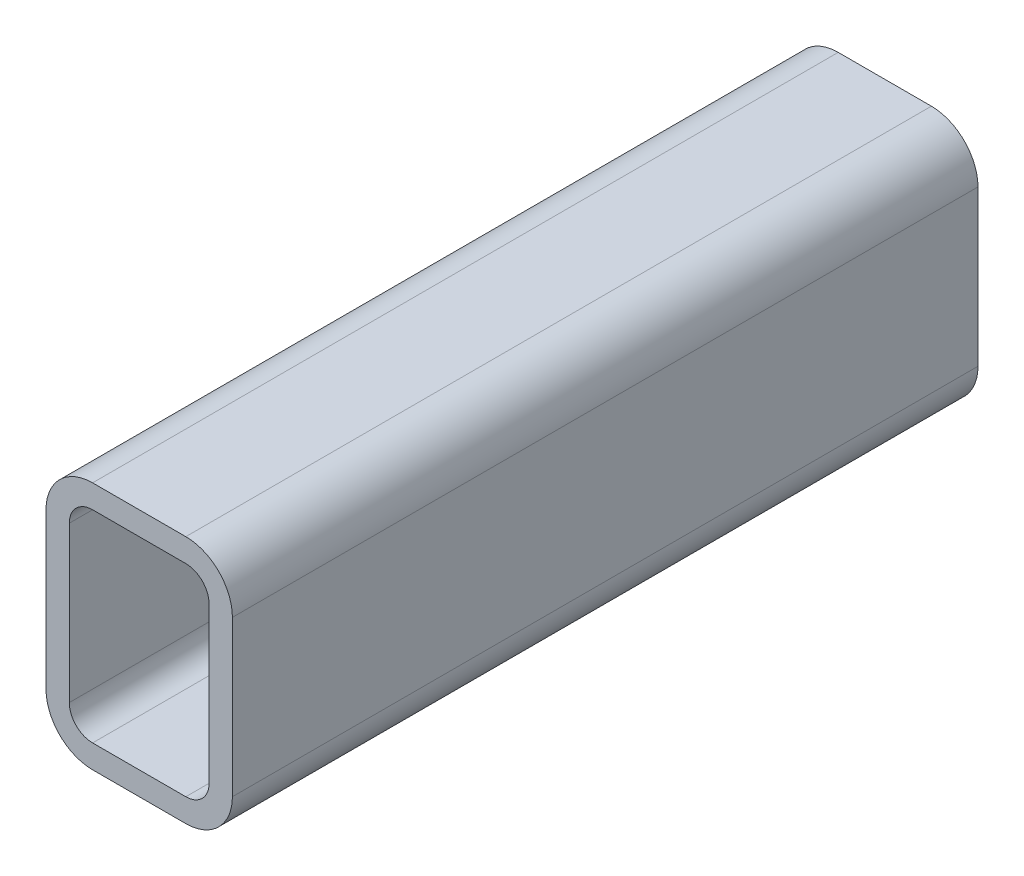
ISO-10303-21;
HEADER;
FILE_DESCRIPTION(('STEP AP214'),'2;1');
FILE_NAME('part.step','',(''),(''),'','','');
FILE_SCHEMA(('AUTOMOTIVE_DESIGN { 1 0 10303 214 1 1 1 1 }'));
ENDSEC;
DATA;
#1=APPLICATION_CONTEXT('core data for automotive mechanical design processes');
#2=APPLICATION_PROTOCOL_DEFINITION('international standard','automotive_design',2000,#1);
#3=PRODUCT_CONTEXT('',#1,'mechanical');
#4=PRODUCT('Part','Part','',(#3));
#5=PRODUCT_RELATED_PRODUCT_CATEGORY('part','',(#4));
#6=PRODUCT_DEFINITION_FORMATION('','',#4);
#7=PRODUCT_DEFINITION_CONTEXT('part definition',#1,'design');
#8=PRODUCT_DEFINITION('design','',#6,#7);
#9=PRODUCT_DEFINITION_SHAPE('','',#8);
#10=(LENGTH_UNIT() NAMED_UNIT(*) SI_UNIT(.MILLI.,.METRE.));
#11=(NAMED_UNIT(*) PLANE_ANGLE_UNIT() SI_UNIT($,.RADIAN.));
#12=(NAMED_UNIT(*) SI_UNIT($,.STERADIAN.) SOLID_ANGLE_UNIT());
#13=UNCERTAINTY_MEASURE_WITH_UNIT(LENGTH_MEASURE(1.E-05),#10,'distance_accuracy_value','');
#14=(GEOMETRIC_REPRESENTATION_CONTEXT(3) GLOBAL_UNCERTAINTY_ASSIGNED_CONTEXT((#13)) GLOBAL_UNIT_ASSIGNED_CONTEXT((#10,
#11,#12)) REPRESENTATION_CONTEXT('',''));
#15=CARTESIAN_POINT('',(0.,0.,0.));
#16=DIRECTION('',(0.,0.,1.));
#17=DIRECTION('',(1.,0.,0.));
#18=AXIS2_PLACEMENT_3D('',#15,#16,#17);
#19=CARTESIAN_POINT('',(21.5391160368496,84.6077651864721,304.8));
#20=DIRECTION('',(0.,0.,1.));
#21=DIRECTION('',(1.,0.,0.));
#22=AXIS2_PLACEMENT_3D('',#19,#20,#21);
#23=PLANE('',#22);
#24=CARTESIAN_POINT('',(21.5391160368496,84.6077651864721,304.8));
#25=DIRECTION('',(0.,0.,1.));
#26=DIRECTION('',(1.,0.,0.));
#27=AXIS2_PLACEMENT_3D('',#24,#25,#26);
#28=CIRCLE('',#27,19.05);
#29=CARTESIAN_POINT('',(21.5391160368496,103.657765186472,304.8));
#30=VERTEX_POINT('',#29);
#31=CARTESIAN_POINT('',(2.48911603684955,84.6077651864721,304.8));
#32=VERTEX_POINT('',#31);
#33=EDGE_CURVE('E211',#30,#32,#28,.T.);
#34=ORIENTED_EDGE('',*,*,#33,.T.);
#35=DIRECTION('',(0.,-1.,0.));
#36=VECTOR('',#35,1.);
#37=CARTESIAN_POINT('',(2.48911603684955,21.1077651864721,304.8));
#38=LINE('',#37,#36);
#39=CARTESIAN_POINT('',(2.48911603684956,21.1077651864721,304.8));
#40=VERTEX_POINT('',#39);
#41=EDGE_CURVE('E214',#32,#40,#38,.T.);
#42=ORIENTED_EDGE('',*,*,#41,.T.);
#43=CARTESIAN_POINT('',(21.5391160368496,21.1077651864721,304.8));
#44=DIRECTION('',(0.,0.,1.));
#45=DIRECTION('',(1.,0.,0.));
#46=AXIS2_PLACEMENT_3D('',#43,#44,#45);
#47=CIRCLE('',#46,19.05);
#48=CARTESIAN_POINT('',(21.5391160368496,2.05776518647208,304.8));
#49=VERTEX_POINT('',#48);
#50=EDGE_CURVE('E217',#40,#49,#47,.T.);
#51=ORIENTED_EDGE('',*,*,#50,.T.);
#52=DIRECTION('',(1.,0.,0.));
#53=VECTOR('',#52,1.);
#54=CARTESIAN_POINT('',(59.6391160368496,2.05776518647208,304.8));
#55=LINE('',#54,#53);
#56=CARTESIAN_POINT('',(59.6391160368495,2.05776518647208,304.8));
#57=VERTEX_POINT('',#56);
#58=EDGE_CURVE('E219',#49,#57,#55,.T.);
#59=ORIENTED_EDGE('',*,*,#58,.T.);
#60=CARTESIAN_POINT('',(59.6391160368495,21.1077651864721,304.8));
#61=DIRECTION('',(0.,0.,1.));
#62=DIRECTION('',(1.,0.,0.));
#63=AXIS2_PLACEMENT_3D('',#60,#61,#62);
#64=CIRCLE('',#63,19.05);
#65=CARTESIAN_POINT('',(78.6891160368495,21.1077651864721,304.8));
#66=VERTEX_POINT('',#65);
#67=EDGE_CURVE('E221',#57,#66,#64,.T.);
#68=ORIENTED_EDGE('',*,*,#67,.T.);
#69=DIRECTION('',(0.,1.,0.));
#70=VECTOR('',#69,1.);
#71=CARTESIAN_POINT('',(78.6891160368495,84.6077651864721,304.8));
#72=LINE('',#71,#70);
#73=CARTESIAN_POINT('',(78.6891160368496,84.6077651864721,304.8));
#74=VERTEX_POINT('',#73);
#75=EDGE_CURVE('E223',#66,#74,#72,.T.);
#76=ORIENTED_EDGE('',*,*,#75,.T.);
#77=CARTESIAN_POINT('',(59.6391160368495,84.6077651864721,304.8));
#78=DIRECTION('',(0.,0.,1.));
#79=DIRECTION('',(1.,0.,0.));
#80=AXIS2_PLACEMENT_3D('',#77,#78,#79);
#81=CIRCLE('',#80,19.05);
#82=CARTESIAN_POINT('',(59.6391160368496,103.657765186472,304.8));
#83=VERTEX_POINT('',#82);
#84=EDGE_CURVE('E225',#74,#83,#81,.T.);
#85=ORIENTED_EDGE('',*,*,#84,.T.);
#86=DIRECTION('',(-1.,0.,0.));
#87=VECTOR('',#86,1.);
#88=CARTESIAN_POINT('',(21.5391160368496,103.657765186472,304.8));
#89=LINE('',#88,#87);
#90=EDGE_CURVE('E227',#83,#30,#89,.T.);
#91=ORIENTED_EDGE('',*,*,#90,.T.);
#92=EDGE_LOOP('',(#34,#42,#51,#59,#68,#76,#85,#91));
#93=FACE_BOUND('',#92,.T.);
#94=DIRECTION('',(0.,-1.,0.));
#95=VECTOR('',#94,1.);
#96=CARTESIAN_POINT('',(12.0141160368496,21.1077651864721,304.8));
#97=LINE('',#96,#95);
#98=CARTESIAN_POINT('',(12.0141160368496,84.6077651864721,304.8));
#99=VERTEX_POINT('',#98);
#100=CARTESIAN_POINT('',(12.0141160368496,21.1077651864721,304.8));
#101=VERTEX_POINT('',#100);
#102=EDGE_CURVE('E154',#99,#101,#97,.T.);
#103=ORIENTED_EDGE('',*,*,#102,.F.);
#104=CARTESIAN_POINT('',(21.5391160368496,84.6077651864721,304.8));
#105=DIRECTION('',(0.,0.,1.));
#106=DIRECTION('',(1.,0.,0.));
#107=AXIS2_PLACEMENT_3D('',#104,#105,#106);
#108=CIRCLE('',#107,9.52500000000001);
#109=CARTESIAN_POINT('',(21.5391160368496,94.1327651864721,304.8));
#110=VERTEX_POINT('',#109);
#111=EDGE_CURVE('E146',#110,#99,#108,.T.);
#112=ORIENTED_EDGE('',*,*,#111,.F.);
#113=DIRECTION('',(-1.,0.,0.));
#114=VECTOR('',#113,1.);
#115=CARTESIAN_POINT('',(21.5391160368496,94.1327651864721,304.8));
#116=LINE('',#115,#114);
#117=CARTESIAN_POINT('',(59.6391160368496,94.1327651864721,304.8));
#118=VERTEX_POINT('',#117);
#119=EDGE_CURVE('E179',#118,#110,#116,.T.);
#120=ORIENTED_EDGE('',*,*,#119,.F.);
#121=CARTESIAN_POINT('',(59.6391160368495,84.6077651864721,304.8));
#122=DIRECTION('',(0.,0.,1.));
#123=DIRECTION('',(1.,0.,0.));
#124=AXIS2_PLACEMENT_3D('',#121,#122,#123);
#125=CIRCLE('',#124,9.52500000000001);
#126=CARTESIAN_POINT('',(69.1641160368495,84.6077651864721,304.8));
#127=VERTEX_POINT('',#126);
#128=EDGE_CURVE('E177',#127,#118,#125,.T.);
#129=ORIENTED_EDGE('',*,*,#128,.F.);
#130=DIRECTION('',(0.,1.,0.));
#131=VECTOR('',#130,1.);
#132=CARTESIAN_POINT('',(69.1641160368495,84.6077651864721,304.8));
#133=LINE('',#132,#131);
#134=CARTESIAN_POINT('',(69.1641160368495,21.1077651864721,304.8));
#135=VERTEX_POINT('',#134);
#136=EDGE_CURVE('E175',#135,#127,#133,.T.);
#137=ORIENTED_EDGE('',*,*,#136,.F.);
#138=CARTESIAN_POINT('',(59.6391160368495,21.1077651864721,304.8));
#139=DIRECTION('',(0.,0.,1.));
#140=DIRECTION('',(1.,0.,0.));
#141=AXIS2_PLACEMENT_3D('',#138,#139,#140);
#142=CIRCLE('',#141,9.525);
#143=CARTESIAN_POINT('',(59.6391160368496,11.5827651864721,304.8));
#144=VERTEX_POINT('',#143);
#145=EDGE_CURVE('E173',#144,#135,#142,.T.);
#146=ORIENTED_EDGE('',*,*,#145,.F.);
#147=DIRECTION('',(1.,0.,0.));
#148=VECTOR('',#147,1.);
#149=CARTESIAN_POINT('',(59.6391160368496,11.5827651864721,304.8));
#150=LINE('',#149,#148);
#151=CARTESIAN_POINT('',(21.5391160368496,11.5827651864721,304.8));
#152=VERTEX_POINT('',#151);
#153=EDGE_CURVE('E169',#152,#144,#150,.T.);
#154=ORIENTED_EDGE('',*,*,#153,.F.);
#155=CARTESIAN_POINT('',(21.5391160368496,21.1077651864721,304.8));
#156=DIRECTION('',(0.,0.,1.));
#157=DIRECTION('',(1.,0.,0.));
#158=AXIS2_PLACEMENT_3D('',#155,#156,#157);
#159=CIRCLE('',#158,9.525);
#160=EDGE_CURVE('E167',#101,#152,#159,.T.);
#161=ORIENTED_EDGE('',*,*,#160,.F.);
#162=EDGE_LOOP('',(#103,#112,#120,#129,#137,#146,#154,#161));
#163=FACE_BOUND('',#162,.T.);
#164=ADVANCED_FACE('F33',(#93,#163),#23,.T.);
#165=CARTESIAN_POINT('',(21.5391160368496,84.6077651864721,0.));
#166=DIRECTION('',(0.,0.,1.));
#167=DIRECTION('',(1.,0.,0.));
#168=AXIS2_PLACEMENT_3D('',#165,#166,#167);
#169=PLANE('',#168);
#170=CARTESIAN_POINT('',(21.5391160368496,84.6077651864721,0.));
#171=DIRECTION('',(0.,0.,1.));
#172=DIRECTION('',(1.,0.,0.));
#173=AXIS2_PLACEMENT_3D('',#170,#171,#172);
#174=CIRCLE('',#173,19.05);
#175=CARTESIAN_POINT('',(21.5391160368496,103.657765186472,0.));
#176=VERTEX_POINT('',#175);
#177=CARTESIAN_POINT('',(2.48911603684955,84.6077651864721,0.));
#178=VERTEX_POINT('',#177);
#179=EDGE_CURVE('E162',#176,#178,#174,.T.);
#180=ORIENTED_EDGE('',*,*,#179,.F.);
#181=DIRECTION('',(-1.,0.,0.));
#182=VECTOR('',#181,1.);
#183=CARTESIAN_POINT('',(21.5391160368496,103.657765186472,0.));
#184=LINE('',#183,#182);
#185=CARTESIAN_POINT('',(59.6391160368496,103.657765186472,0.));
#186=VERTEX_POINT('',#185);
#187=EDGE_CURVE('E215',#186,#176,#184,.T.);
#188=ORIENTED_EDGE('',*,*,#187,.F.);
#189=CARTESIAN_POINT('',(59.6391160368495,84.6077651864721,0.));
#190=DIRECTION('',(0.,0.,1.));
#191=DIRECTION('',(1.,0.,0.));
#192=AXIS2_PLACEMENT_3D('',#189,#190,#191);
#193=CIRCLE('',#192,19.05);
#194=CARTESIAN_POINT('',(78.6891160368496,84.6077651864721,0.));
#195=VERTEX_POINT('',#194);
#196=EDGE_CURVE('E242',#195,#186,#193,.T.);
#197=ORIENTED_EDGE('',*,*,#196,.F.);
#198=DIRECTION('',(0.,1.,0.));
#199=VECTOR('',#198,1.);
#200=CARTESIAN_POINT('',(78.6891160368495,84.6077651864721,0.));
#201=LINE('',#200,#199);
#202=CARTESIAN_POINT('',(78.6891160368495,21.1077651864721,0.));
#203=VERTEX_POINT('',#202);
#204=EDGE_CURVE('E240',#203,#195,#201,.T.);
#205=ORIENTED_EDGE('',*,*,#204,.F.);
#206=CARTESIAN_POINT('',(59.6391160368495,21.1077651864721,0.));
#207=DIRECTION('',(0.,0.,1.));
#208=DIRECTION('',(1.,0.,0.));
#209=AXIS2_PLACEMENT_3D('',#206,#207,#208);
#210=CIRCLE('',#209,19.05);
#211=CARTESIAN_POINT('',(59.6391160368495,2.05776518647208,0.));
#212=VERTEX_POINT('',#211);
#213=EDGE_CURVE('E238',#212,#203,#210,.T.);
#214=ORIENTED_EDGE('',*,*,#213,.F.);
#215=DIRECTION('',(1.,0.,0.));
#216=VECTOR('',#215,1.);
#217=CARTESIAN_POINT('',(59.6391160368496,2.05776518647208,0.));
#218=LINE('',#217,#216);
#219=CARTESIAN_POINT('',(21.5391160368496,2.05776518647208,0.));
#220=VERTEX_POINT('',#219);
#221=EDGE_CURVE('E236',#220,#212,#218,.T.);
#222=ORIENTED_EDGE('',*,*,#221,.F.);
#223=CARTESIAN_POINT('',(21.5391160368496,21.1077651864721,0.));
#224=DIRECTION('',(0.,0.,1.));
#225=DIRECTION('',(1.,0.,0.));
#226=AXIS2_PLACEMENT_3D('',#223,#224,#225);
#227=CIRCLE('',#226,19.05);
#228=CARTESIAN_POINT('',(2.48911603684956,21.1077651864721,0.));
#229=VERTEX_POINT('',#228);
#230=EDGE_CURVE('E234',#229,#220,#227,.T.);
#231=ORIENTED_EDGE('',*,*,#230,.F.);
#232=DIRECTION('',(0.,-1.,0.));
#233=VECTOR('',#232,1.);
#234=CARTESIAN_POINT('',(2.48911603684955,21.1077651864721,0.));
#235=LINE('',#234,#233);
#236=EDGE_CURVE('E232',#178,#229,#235,.T.);
#237=ORIENTED_EDGE('',*,*,#236,.F.);
#238=EDGE_LOOP('',(#180,#188,#197,#205,#214,#222,#231,#237));
#239=FACE_BOUND('',#238,.T.);
#240=CARTESIAN_POINT('',(21.5391160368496,84.6077651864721,0.));
#241=DIRECTION('',(0.,0.,1.));
#242=DIRECTION('',(1.,0.,0.));
#243=AXIS2_PLACEMENT_3D('',#240,#241,#242);
#244=CIRCLE('',#243,9.52500000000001);
#245=CARTESIAN_POINT('',(21.5391160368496,94.1327651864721,0.));
#246=VERTEX_POINT('',#245);
#247=CARTESIAN_POINT('',(12.0141160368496,84.6077651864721,0.));
#248=VERTEX_POINT('',#247);
#249=EDGE_CURVE('E56',#246,#248,#244,.T.);
#250=ORIENTED_EDGE('',*,*,#249,.T.);
#251=DIRECTION('',(0.,-1.,0.));
#252=VECTOR('',#251,1.);
#253=CARTESIAN_POINT('',(12.0141160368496,21.1077651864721,0.));
#254=LINE('',#253,#252);
#255=CARTESIAN_POINT('',(12.0141160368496,21.1077651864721,0.));
#256=VERTEX_POINT('',#255);
#257=EDGE_CURVE('E161',#248,#256,#254,.T.);
#258=ORIENTED_EDGE('',*,*,#257,.T.);
#259=CARTESIAN_POINT('',(21.5391160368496,21.1077651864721,0.));
#260=DIRECTION('',(0.,0.,1.));
#261=DIRECTION('',(1.,0.,0.));
#262=AXIS2_PLACEMENT_3D('',#259,#260,#261);
#263=CIRCLE('',#262,9.525);
#264=CARTESIAN_POINT('',(21.5391160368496,11.5827651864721,0.));
#265=VERTEX_POINT('',#264);
#266=EDGE_CURVE('E183',#256,#265,#263,.T.);
#267=ORIENTED_EDGE('',*,*,#266,.T.);
#268=DIRECTION('',(1.,0.,0.));
#269=VECTOR('',#268,1.);
#270=CARTESIAN_POINT('',(59.6391160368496,11.5827651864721,0.));
#271=LINE('',#270,#269);
#272=CARTESIAN_POINT('',(59.6391160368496,11.5827651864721,0.));
#273=VERTEX_POINT('',#272);
#274=EDGE_CURVE('E186',#265,#273,#271,.T.);
#275=ORIENTED_EDGE('',*,*,#274,.T.);
#276=CARTESIAN_POINT('',(59.6391160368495,21.1077651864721,0.));
#277=DIRECTION('',(0.,0.,1.));
#278=DIRECTION('',(1.,0.,0.));
#279=AXIS2_PLACEMENT_3D('',#276,#277,#278);
#280=CIRCLE('',#279,9.525);
#281=CARTESIAN_POINT('',(69.1641160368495,21.1077651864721,0.));
#282=VERTEX_POINT('',#281);
#283=EDGE_CURVE('E189',#273,#282,#280,.T.);
#284=ORIENTED_EDGE('',*,*,#283,.T.);
#285=DIRECTION('',(0.,1.,0.));
#286=VECTOR('',#285,1.);
#287=CARTESIAN_POINT('',(69.1641160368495,84.6077651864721,0.));
#288=LINE('',#287,#286);
#289=CARTESIAN_POINT('',(69.1641160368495,84.6077651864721,0.));
#290=VERTEX_POINT('',#289);
#291=EDGE_CURVE('E192',#282,#290,#288,.T.);
#292=ORIENTED_EDGE('',*,*,#291,.T.);
#293=CARTESIAN_POINT('',(59.6391160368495,84.6077651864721,0.));
#294=DIRECTION('',(0.,0.,1.));
#295=DIRECTION('',(1.,0.,0.));
#296=AXIS2_PLACEMENT_3D('',#293,#294,#295);
#297=CIRCLE('',#296,9.52500000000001);
#298=CARTESIAN_POINT('',(59.6391160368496,94.1327651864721,0.));
#299=VERTEX_POINT('',#298);
#300=EDGE_CURVE('E195',#290,#299,#297,.T.);
#301=ORIENTED_EDGE('',*,*,#300,.T.);
#302=DIRECTION('',(-1.,0.,0.));
#303=VECTOR('',#302,1.);
#304=CARTESIAN_POINT('',(21.5391160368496,94.1327651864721,0.));
#305=LINE('',#304,#303);
#306=EDGE_CURVE('E155',#299,#246,#305,.T.);
#307=ORIENTED_EDGE('',*,*,#306,.T.);
#308=EDGE_LOOP('',(#250,#258,#267,#275,#284,#292,#301,#307));
#309=FACE_BOUND('',#308,.T.);
#310=ADVANCED_FACE('F272',(#239,#309),#169,.F.);
#311=CARTESIAN_POINT('',(21.5391160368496,84.6077651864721,304.8));
#312=DIRECTION('',(0.,0.,-1.));
#313=DIRECTION('',(-1.,0.,0.));
#314=AXIS2_PLACEMENT_3D('',#311,#312,#313);
#315=CYLINDRICAL_SURFACE('',#314,19.05);
#316=ORIENTED_EDGE('',*,*,#179,.T.);
#317=DIRECTION('',(0.,0.,-1.));
#318=VECTOR('',#317,1.);
#319=CARTESIAN_POINT('',(2.48911603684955,84.6077651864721,304.8));
#320=LINE('',#319,#318);
#321=EDGE_CURVE('E11',#32,#178,#320,.T.);
#322=ORIENTED_EDGE('',*,*,#321,.F.);
#323=ORIENTED_EDGE('',*,*,#33,.F.);
#324=DIRECTION('',(0.,0.,-1.));
#325=VECTOR('',#324,1.);
#326=CARTESIAN_POINT('',(21.5391160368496,103.657765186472,304.8));
#327=LINE('',#326,#325);
#328=EDGE_CURVE('E229',#30,#176,#327,.T.);
#329=ORIENTED_EDGE('',*,*,#328,.T.);
#330=EDGE_LOOP('',(#316,#322,#323,#329));
#331=FACE_BOUND('',#330,.T.);
#332=ADVANCED_FACE('F35',(#331),#315,.T.);
#333=CARTESIAN_POINT('',(2.48911603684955,21.1077651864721,304.8));
#334=DIRECTION('',(1.,0.,0.));
#335=DIRECTION('',(0.,0.,-1.));
#336=AXIS2_PLACEMENT_3D('',#333,#334,#335);
#337=PLANE('',#336);
#338=ORIENTED_EDGE('',*,*,#236,.T.);
#339=DIRECTION('',(0.,0.,-1.));
#340=VECTOR('',#339,1.);
#341=CARTESIAN_POINT('',(2.48911603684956,21.1077651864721,304.8));
#342=LINE('',#341,#340);
#343=EDGE_CURVE('E41',#40,#229,#342,.T.);
#344=ORIENTED_EDGE('',*,*,#343,.F.);
#345=ORIENTED_EDGE('',*,*,#41,.F.);
#346=ORIENTED_EDGE('',*,*,#321,.T.);
#347=EDGE_LOOP('',(#338,#344,#345,#346));
#348=FACE_BOUND('',#347,.T.);
#349=ADVANCED_FACE('F289',(#348),#337,.F.);
#350=CARTESIAN_POINT('',(21.5391160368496,21.1077651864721,304.8));
#351=DIRECTION('',(0.,0.,-1.));
#352=DIRECTION('',(-1.,0.,0.));
#353=AXIS2_PLACEMENT_3D('',#350,#351,#352);
#354=CYLINDRICAL_SURFACE('',#353,19.05);
#355=ORIENTED_EDGE('',*,*,#230,.T.);
#356=DIRECTION('',(0.,0.,-1.));
#357=VECTOR('',#356,1.);
#358=CARTESIAN_POINT('',(21.5391160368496,2.05776518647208,304.8));
#359=LINE('',#358,#357);
#360=EDGE_CURVE('E259',#49,#220,#359,.T.);
#361=ORIENTED_EDGE('',*,*,#360,.F.);
#362=ORIENTED_EDGE('',*,*,#50,.F.);
#363=ORIENTED_EDGE('',*,*,#343,.T.);
#364=EDGE_LOOP('',(#355,#361,#362,#363));
#365=FACE_BOUND('',#364,.T.);
#366=ADVANCED_FACE('F266',(#365),#354,.T.);
#367=CARTESIAN_POINT('',(59.6391160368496,2.05776518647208,304.8));
#368=DIRECTION('',(0.,1.,0.));
#369=DIRECTION('',(0.,0.,1.));
#370=AXIS2_PLACEMENT_3D('',#367,#368,#369);
#371=PLANE('',#370);
#372=ORIENTED_EDGE('',*,*,#221,.T.);
#373=DIRECTION('',(0.,0.,-1.));
#374=VECTOR('',#373,1.);
#375=CARTESIAN_POINT('',(59.6391160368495,2.05776518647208,304.8));
#376=LINE('',#375,#374);
#377=EDGE_CURVE('E256',#57,#212,#376,.T.);
#378=ORIENTED_EDGE('',*,*,#377,.F.);
#379=ORIENTED_EDGE('',*,*,#58,.F.);
#380=ORIENTED_EDGE('',*,*,#360,.T.);
#381=EDGE_LOOP('',(#372,#378,#379,#380));
#382=FACE_BOUND('',#381,.T.);
#383=ADVANCED_FACE('F278',(#382),#371,.F.);
#384=CARTESIAN_POINT('',(59.6391160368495,21.1077651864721,304.8));
#385=DIRECTION('',(0.,0.,-1.));
#386=DIRECTION('',(-1.,0.,0.));
#387=AXIS2_PLACEMENT_3D('',#384,#385,#386);
#388=CYLINDRICAL_SURFACE('',#387,19.05);
#389=ORIENTED_EDGE('',*,*,#213,.T.);
#390=DIRECTION('',(0.,0.,-1.));
#391=VECTOR('',#390,1.);
#392=CARTESIAN_POINT('',(78.6891160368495,21.1077651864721,304.8));
#393=LINE('',#392,#391);
#394=EDGE_CURVE('E253',#66,#203,#393,.T.);
#395=ORIENTED_EDGE('',*,*,#394,.F.);
#396=ORIENTED_EDGE('',*,*,#67,.F.);
#397=ORIENTED_EDGE('',*,*,#377,.T.);
#398=EDGE_LOOP('',(#389,#395,#396,#397));
#399=FACE_BOUND('',#398,.T.);
#400=ADVANCED_FACE('F282',(#399),#388,.T.);
#401=CARTESIAN_POINT('',(78.6891160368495,84.6077651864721,304.8));
#402=DIRECTION('',(-1.,0.,0.));
#403=DIRECTION('',(0.,0.,1.));
#404=AXIS2_PLACEMENT_3D('',#401,#402,#403);
#405=PLANE('',#404);
#406=ORIENTED_EDGE('',*,*,#204,.T.);
#407=DIRECTION('',(0.,0.,-1.));
#408=VECTOR('',#407,1.);
#409=CARTESIAN_POINT('',(78.6891160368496,84.6077651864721,304.8));
#410=LINE('',#409,#408);
#411=EDGE_CURVE('E250',#74,#195,#410,.T.);
#412=ORIENTED_EDGE('',*,*,#411,.F.);
#413=ORIENTED_EDGE('',*,*,#75,.F.);
#414=ORIENTED_EDGE('',*,*,#394,.T.);
#415=EDGE_LOOP('',(#406,#412,#413,#414));
#416=FACE_BOUND('',#415,.T.);
#417=ADVANCED_FACE('F302',(#416),#405,.F.);
#418=CARTESIAN_POINT('',(59.6391160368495,84.6077651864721,304.8));
#419=DIRECTION('',(0.,0.,-1.));
#420=DIRECTION('',(-1.,0.,0.));
#421=AXIS2_PLACEMENT_3D('',#418,#419,#420);
#422=CYLINDRICAL_SURFACE('',#421,19.05);
#423=ORIENTED_EDGE('',*,*,#196,.T.);
#424=DIRECTION('',(0.,0.,-1.));
#425=VECTOR('',#424,1.);
#426=CARTESIAN_POINT('',(59.6391160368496,103.657765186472,304.8));
#427=LINE('',#426,#425);
#428=EDGE_CURVE('E247',#83,#186,#427,.T.);
#429=ORIENTED_EDGE('',*,*,#428,.F.);
#430=ORIENTED_EDGE('',*,*,#84,.F.);
#431=ORIENTED_EDGE('',*,*,#411,.T.);
#432=EDGE_LOOP('',(#423,#429,#430,#431));
#433=FACE_BOUND('',#432,.T.);
#434=ADVANCED_FACE('F300',(#433),#422,.T.);
#435=CARTESIAN_POINT('',(21.5391160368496,103.657765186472,304.8));
#436=DIRECTION('',(0.,-1.,0.));
#437=DIRECTION('',(0.,0.,-1.));
#438=AXIS2_PLACEMENT_3D('',#435,#436,#437);
#439=PLANE('',#438);
#440=ORIENTED_EDGE('',*,*,#187,.T.);
#441=ORIENTED_EDGE('',*,*,#328,.F.);
#442=ORIENTED_EDGE('',*,*,#90,.F.);
#443=ORIENTED_EDGE('',*,*,#428,.T.);
#444=EDGE_LOOP('',(#440,#441,#442,#443));
#445=FACE_BOUND('',#444,.T.);
#446=ADVANCED_FACE('F295',(#445),#439,.F.);
#447=CARTESIAN_POINT('',(21.5391160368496,84.6077651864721,304.8));
#448=DIRECTION('',(0.,0.,-1.));
#449=DIRECTION('',(-1.,0.,0.));
#450=AXIS2_PLACEMENT_3D('',#447,#448,#449);
#451=CYLINDRICAL_SURFACE('',#450,9.52500000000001);
#452=ORIENTED_EDGE('',*,*,#249,.F.);
#453=DIRECTION('',(0.,0.,-1.));
#454=VECTOR('',#453,1.);
#455=CARTESIAN_POINT('',(21.5391160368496,94.1327651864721,304.8));
#456=LINE('',#455,#454);
#457=EDGE_CURVE('E150',#110,#246,#456,.T.);
#458=ORIENTED_EDGE('',*,*,#457,.F.);
#459=ORIENTED_EDGE('',*,*,#111,.T.);
#460=DIRECTION('',(0.,0.,-1.));
#461=VECTOR('',#460,1.);
#462=CARTESIAN_POINT('',(12.0141160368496,84.6077651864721,304.8));
#463=LINE('',#462,#461);
#464=EDGE_CURVE('E149',#99,#248,#463,.T.);
#465=ORIENTED_EDGE('',*,*,#464,.T.);
#466=EDGE_LOOP('',(#452,#458,#459,#465));
#467=FACE_BOUND('',#466,.T.);
#468=ADVANCED_FACE('F148',(#467),#451,.F.);
#469=CARTESIAN_POINT('',(12.0141160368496,21.1077651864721,304.8));
#470=DIRECTION('',(1.,0.,0.));
#471=DIRECTION('',(0.,0.,-1.));
#472=AXIS2_PLACEMENT_3D('',#469,#470,#471);
#473=PLANE('',#472);
#474=ORIENTED_EDGE('',*,*,#257,.F.);
#475=ORIENTED_EDGE('',*,*,#464,.F.);
#476=ORIENTED_EDGE('',*,*,#102,.T.);
#477=DIRECTION('',(0.,0.,-1.));
#478=VECTOR('',#477,1.);
#479=CARTESIAN_POINT('',(12.0141160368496,21.1077651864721,304.8));
#480=LINE('',#479,#478);
#481=EDGE_CURVE('E163',#101,#256,#480,.T.);
#482=ORIENTED_EDGE('',*,*,#481,.T.);
#483=EDGE_LOOP('',(#474,#475,#476,#482));
#484=FACE_BOUND('',#483,.T.);
#485=ADVANCED_FACE('F158',(#484),#473,.T.);
#486=CARTESIAN_POINT('',(21.5391160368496,21.1077651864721,304.8));
#487=DIRECTION('',(0.,0.,-1.));
#488=DIRECTION('',(-1.,0.,0.));
#489=AXIS2_PLACEMENT_3D('',#486,#487,#488);
#490=CYLINDRICAL_SURFACE('',#489,9.525);
#491=ORIENTED_EDGE('',*,*,#266,.F.);
#492=ORIENTED_EDGE('',*,*,#481,.F.);
#493=ORIENTED_EDGE('',*,*,#160,.T.);
#494=DIRECTION('',(0.,0.,-1.));
#495=VECTOR('',#494,1.);
#496=CARTESIAN_POINT('',(21.5391160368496,11.5827651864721,304.8));
#497=LINE('',#496,#495);
#498=EDGE_CURVE('E208',#152,#265,#497,.T.);
#499=ORIENTED_EDGE('',*,*,#498,.T.);
#500=EDGE_LOOP('',(#491,#492,#493,#499));
#501=FACE_BOUND('',#500,.T.);
#502=ADVANCED_FACE('F327',(#501),#490,.F.);
#503=CARTESIAN_POINT('',(59.6391160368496,11.5827651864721,304.8));
#504=DIRECTION('',(0.,1.,0.));
#505=DIRECTION('',(0.,0.,1.));
#506=AXIS2_PLACEMENT_3D('',#503,#504,#505);
#507=PLANE('',#506);
#508=ORIENTED_EDGE('',*,*,#274,.F.);
#509=ORIENTED_EDGE('',*,*,#498,.F.);
#510=ORIENTED_EDGE('',*,*,#153,.T.);
#511=DIRECTION('',(0.,0.,-1.));
#512=VECTOR('',#511,1.);
#513=CARTESIAN_POINT('',(59.6391160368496,11.5827651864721,304.8));
#514=LINE('',#513,#512);
#515=EDGE_CURVE('E206',#144,#273,#514,.T.);
#516=ORIENTED_EDGE('',*,*,#515,.T.);
#517=EDGE_LOOP('',(#508,#509,#510,#516));
#518=FACE_BOUND('',#517,.T.);
#519=ADVANCED_FACE('F331',(#518),#507,.T.);
#520=CARTESIAN_POINT('',(59.6391160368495,21.1077651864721,304.8));
#521=DIRECTION('',(0.,0.,-1.));
#522=DIRECTION('',(-1.,0.,0.));
#523=AXIS2_PLACEMENT_3D('',#520,#521,#522);
#524=CYLINDRICAL_SURFACE('',#523,9.525);
#525=ORIENTED_EDGE('',*,*,#283,.F.);
#526=ORIENTED_EDGE('',*,*,#515,.F.);
#527=ORIENTED_EDGE('',*,*,#145,.T.);
#528=DIRECTION('',(0.,0.,-1.));
#529=VECTOR('',#528,1.);
#530=CARTESIAN_POINT('',(69.1641160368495,21.1077651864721,304.8));
#531=LINE('',#530,#529);
#532=EDGE_CURVE('E204',#135,#282,#531,.T.);
#533=ORIENTED_EDGE('',*,*,#532,.T.);
#534=EDGE_LOOP('',(#525,#526,#527,#533));
#535=FACE_BOUND('',#534,.T.);
#536=ADVANCED_FACE('F337',(#535),#524,.F.);
#537=CARTESIAN_POINT('',(69.1641160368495,84.6077651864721,304.8));
#538=DIRECTION('',(-1.,0.,0.));
#539=DIRECTION('',(0.,0.,1.));
#540=AXIS2_PLACEMENT_3D('',#537,#538,#539);
#541=PLANE('',#540);
#542=ORIENTED_EDGE('',*,*,#291,.F.);
#543=ORIENTED_EDGE('',*,*,#532,.F.);
#544=ORIENTED_EDGE('',*,*,#136,.T.);
#545=DIRECTION('',(0.,0.,-1.));
#546=VECTOR('',#545,1.);
#547=CARTESIAN_POINT('',(69.1641160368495,84.6077651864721,304.8));
#548=LINE('',#547,#546);
#549=EDGE_CURVE('E202',#127,#290,#548,.T.);
#550=ORIENTED_EDGE('',*,*,#549,.T.);
#551=EDGE_LOOP('',(#542,#543,#544,#550));
#552=FACE_BOUND('',#551,.T.);
#553=ADVANCED_FACE('F341',(#552),#541,.T.);
#554=CARTESIAN_POINT('',(59.6391160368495,84.6077651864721,304.8));
#555=DIRECTION('',(0.,0.,-1.));
#556=DIRECTION('',(-1.,0.,0.));
#557=AXIS2_PLACEMENT_3D('',#554,#555,#556);
#558=CYLINDRICAL_SURFACE('',#557,9.52500000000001);
#559=ORIENTED_EDGE('',*,*,#300,.F.);
#560=ORIENTED_EDGE('',*,*,#549,.F.);
#561=ORIENTED_EDGE('',*,*,#128,.T.);
#562=DIRECTION('',(0.,0.,-1.));
#563=VECTOR('',#562,1.);
#564=CARTESIAN_POINT('',(59.6391160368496,94.1327651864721,304.8));
#565=LINE('',#564,#563);
#566=EDGE_CURVE('E48',#118,#299,#565,.T.);
#567=ORIENTED_EDGE('',*,*,#566,.T.);
#568=EDGE_LOOP('',(#559,#560,#561,#567));
#569=FACE_BOUND('',#568,.T.);
#570=ADVANCED_FACE('F345',(#569),#558,.F.);
#571=CARTESIAN_POINT('',(21.5391160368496,94.1327651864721,304.8));
#572=DIRECTION('',(0.,-1.,0.));
#573=DIRECTION('',(0.,0.,-1.));
#574=AXIS2_PLACEMENT_3D('',#571,#572,#573);
#575=PLANE('',#574);
#576=ORIENTED_EDGE('',*,*,#306,.F.);
#577=ORIENTED_EDGE('',*,*,#566,.F.);
#578=ORIENTED_EDGE('',*,*,#119,.T.);
#579=ORIENTED_EDGE('',*,*,#457,.T.);
#580=EDGE_LOOP('',(#576,#577,#578,#579));
#581=FACE_BOUND('',#580,.T.);
#582=ADVANCED_FACE('F349',(#581),#575,.T.);
#583=CLOSED_SHELL('',(#164,#310,#332,#349,#366,#383,#400,#417,#434,#446,#468,#485,#502,#519,
#536,#553,#570,#582));
#584=MANIFOLD_SOLID_BREP('B2',#583);
#585=ADVANCED_BREP_SHAPE_REPRESENTATION('',(#18,#584),#14);
#586=SHAPE_DEFINITION_REPRESENTATION(#9,#585);
ENDSEC;
END-ISO-10303-21;
